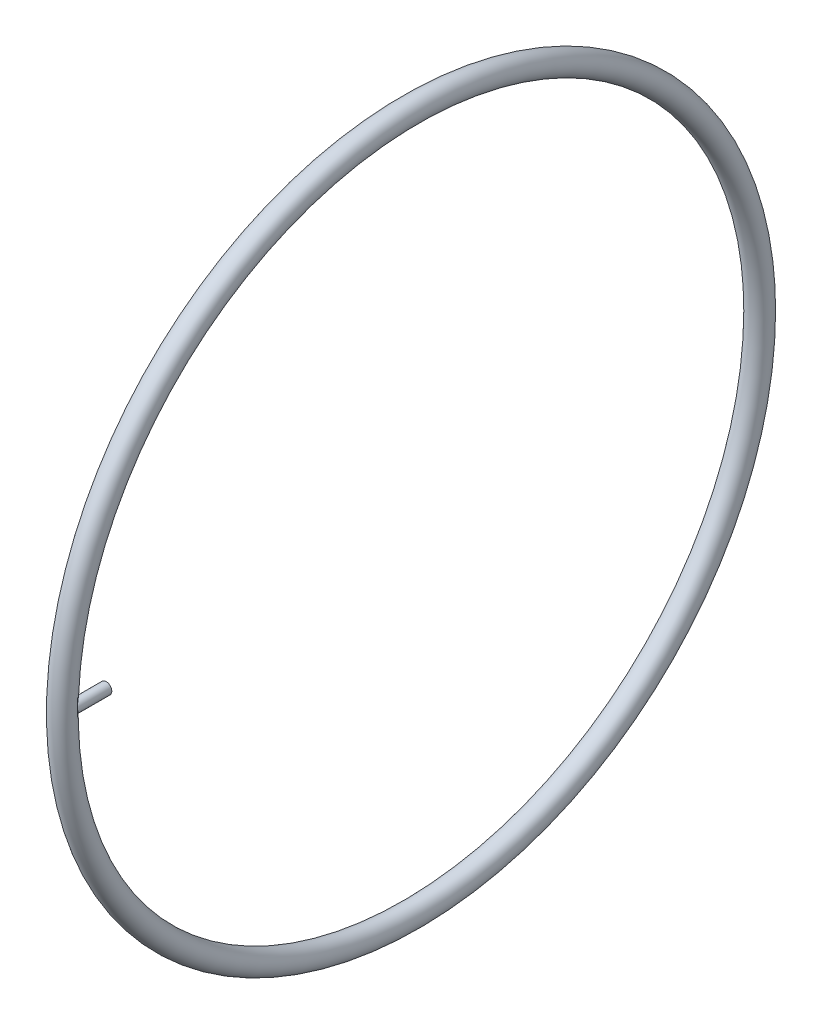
ISO-10303-21;
HEADER;
FILE_DESCRIPTION(('STEP AP214'),'2;1');
FILE_NAME('part.step','',(''),(''),'','','');
FILE_SCHEMA(('AUTOMOTIVE_DESIGN { 1 0 10303 214 1 1 1 1 }'));
ENDSEC;
DATA;
#1=APPLICATION_CONTEXT('core data for automotive mechanical design processes');
#2=APPLICATION_PROTOCOL_DEFINITION('international standard','automotive_design',2000,#1);
#3=PRODUCT_CONTEXT('',#1,'mechanical');
#4=PRODUCT('Part','Part','',(#3));
#5=PRODUCT_RELATED_PRODUCT_CATEGORY('part','',(#4));
#6=PRODUCT_DEFINITION_FORMATION('','',#4);
#7=PRODUCT_DEFINITION_CONTEXT('part definition',#1,'design');
#8=PRODUCT_DEFINITION('design','',#6,#7);
#9=PRODUCT_DEFINITION_SHAPE('','',#8);
#10=(LENGTH_UNIT() NAMED_UNIT(*) SI_UNIT(.MILLI.,.METRE.));
#11=(NAMED_UNIT(*) PLANE_ANGLE_UNIT() SI_UNIT($,.RADIAN.));
#12=(NAMED_UNIT(*) SI_UNIT($,.STERADIAN.) SOLID_ANGLE_UNIT());
#13=UNCERTAINTY_MEASURE_WITH_UNIT(LENGTH_MEASURE(1.E-05),#10,'distance_accuracy_value','');
#14=(GEOMETRIC_REPRESENTATION_CONTEXT(3) GLOBAL_UNCERTAINTY_ASSIGNED_CONTEXT((#13)) GLOBAL_UNIT_ASSIGNED_CONTEXT((#10,
#11,#12)) REPRESENTATION_CONTEXT('',''));
#15=CARTESIAN_POINT('',(0.,0.,0.));
#16=DIRECTION('',(0.,0.,1.));
#17=DIRECTION('',(1.,0.,0.));
#18=AXIS2_PLACEMENT_3D('',#15,#16,#17);
#19=CARTESIAN_POINT('',(0.,0.,0.));
#20=DIRECTION('',(-1.,0.,0.));
#21=DIRECTION('',(0.,0.,1.));
#22=AXIS2_PLACEMENT_3D('',#19,#20,#21);
#23=TOROIDAL_SURFACE('',#22,310.,10.);
#24=CARTESIAN_POINT('',(-3.43548307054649,-3.63283031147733,300.586697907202));
#25=CARTESIAN_POINT('',(-3.63863055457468,-3.44071791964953,300.663343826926));
#26=CARTESIAN_POINT('',(-3.8255240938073,-3.23170310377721,300.741560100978));
#27=CARTESIAN_POINT('',(-4.16289787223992,-2.78370333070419,300.893016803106));
#28=CARTESIAN_POINT('',(-4.31330807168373,-2.54466204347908,300.966247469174));
#29=CARTESIAN_POINT('',(-4.5082572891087,-2.16699418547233,301.065811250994));
#30=CARTESIAN_POINT('',(-4.56825254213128,-2.03753535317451,301.097358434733));
#31=CARTESIAN_POINT('',(-4.67724138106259,-1.77308692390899,301.155850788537));
#32=CARTESIAN_POINT('',(-4.72624008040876,-1.63809993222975,301.182798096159));
#33=CARTESIAN_POINT('',(-4.81259908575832,-1.36365745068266,301.231027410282));
#34=CARTESIAN_POINT('',(-4.84997409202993,-1.22420785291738,301.25231656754));
#35=CARTESIAN_POINT('',(-4.91263070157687,-0.941790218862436,301.288374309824));
#36=CARTESIAN_POINT('',(-4.93791400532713,-0.798822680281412,301.303143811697));
#37=CARTESIAN_POINT('',(-4.97421133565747,-0.524034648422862,301.324458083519));
#38=CARTESIAN_POINT('',(-4.98633031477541,-0.392408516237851,301.331638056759));
#39=CARTESIAN_POINT('',(-5.00009728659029,-0.128421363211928,301.339799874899));
#40=CARTESIAN_POINT('',(-5.00174608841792,0.00393960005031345,301.340782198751));
#41=CARTESIAN_POINT('',(-4.99454848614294,0.268263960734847,301.33650945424));
#42=CARTESIAN_POINT('',(-4.98570270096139,0.400227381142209,301.331254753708));
#43=CARTESIAN_POINT('',(-4.95765043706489,0.662659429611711,301.314718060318));
#44=CARTESIAN_POINT('',(-4.93844417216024,0.793128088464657,301.303436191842));
#45=CARTESIAN_POINT('',(-4.89188447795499,1.04119726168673,301.276405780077));
#46=CARTESIAN_POINT('',(-4.86530686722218,1.1589914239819,301.261087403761));
#47=CARTESIAN_POINT('',(-4.80390050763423,1.39177880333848,301.226187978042));
#48=CARTESIAN_POINT('',(-4.76906900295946,1.50677107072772,301.206605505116));
#49=CARTESIAN_POINT('',(-4.6526817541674,1.84656430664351,301.142285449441));
#50=CARTESIAN_POINT('',(-4.55920311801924,2.06633981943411,301.091956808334));
#51=CARTESIAN_POINT('',(-4.33377226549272,2.50700055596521,300.97657104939));
#52=CARTESIAN_POINT('',(-4.19914933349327,2.72626617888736,300.910605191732));
#53=CARTESIAN_POINT('',(-3.89890155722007,3.14072383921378,300.773594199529));
#54=CARTESIAN_POINT('',(-3.73325656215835,3.33590009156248,300.702545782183));
#55=CARTESIAN_POINT('',(-3.35195012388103,3.72106590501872,300.553091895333));
#56=CARTESIAN_POINT('',(-3.1326627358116,3.90757471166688,300.474835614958));
#57=CARTESIAN_POINT('',(-2.78078479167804,4.15788845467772,300.364863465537));
#58=CARTESIAN_POINT('',(-2.65958685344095,4.23645698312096,300.329422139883));
#59=CARTESIAN_POINT('',(-2.41015380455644,4.38315609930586,300.261951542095));
#60=CARTESIAN_POINT('',(-2.28192218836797,4.45129180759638,300.229920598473));
#61=CARTESIAN_POINT('',(-2.02057923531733,4.57580538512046,300.170491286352));
#62=CARTESIAN_POINT('',(-1.8875338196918,4.63229994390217,300.143047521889));
#63=CARTESIAN_POINT('',(-1.61627023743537,4.73377485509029,300.093190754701));
#64=CARTESIAN_POINT('',(-1.47805459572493,4.77876074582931,300.070775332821));
#65=CARTESIAN_POINT('',(-1.19754984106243,4.85665003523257,300.031654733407));
#66=CARTESIAN_POINT('',(-1.0552630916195,4.88956029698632,300.014946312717));
#67=CARTESIAN_POINT('',(-0.767782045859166,4.94286089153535,299.987756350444));
#68=CARTESIAN_POINT('',(-0.622588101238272,4.9632527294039,299.977274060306));
#69=CARTESIAN_POINT('',(-0.346139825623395,4.98972704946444,299.963640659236));
#70=CARTESIAN_POINT('',(-0.215039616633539,4.997097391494,299.959830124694));
#71=CARTESIAN_POINT('',(0.0473780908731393,5.00149699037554,299.957557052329));
#72=CARTESIAN_POINT('',(0.178695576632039,4.99852683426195,299.959094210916));
#73=CARTESIAN_POINT('',(0.440498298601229,4.98228470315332,299.967474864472));
#74=CARTESIAN_POINT('',(0.570983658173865,4.96901429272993,299.974317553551));
#75=CARTESIAN_POINT('',(0.830144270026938,4.93234119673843,299.993125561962));
#76=CARTESIAN_POINT('',(0.958819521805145,4.90893850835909,300.005090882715));
#77=CARTESIAN_POINT('',(1.20790812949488,4.85350603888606,300.033211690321));
#78=CARTESIAN_POINT('',(1.32843780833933,4.82189429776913,300.049163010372));
#79=CARTESIAN_POINT('',(1.56626943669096,4.74997437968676,300.085100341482));
#80=CARTESIAN_POINT('',(1.68357033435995,4.70966340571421,300.105087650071));
#81=CARTESIAN_POINT('',(2.02956060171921,4.57623018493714,300.170455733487));
#82=CARTESIAN_POINT('',(2.25252714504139,4.4705648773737,300.221265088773));
#83=CARTESIAN_POINT('',(2.69335050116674,4.22072963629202,300.337031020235));
#84=CARTESIAN_POINT('',(2.90977004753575,4.07439062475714,300.402726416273));
#85=CARTESIAN_POINT('',(3.31627797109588,3.75097365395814,300.540107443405));
#86=CARTESIAN_POINT('',(3.50634823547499,3.57387473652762,300.611797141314));
#87=CARTESIAN_POINT('',(3.87478578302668,3.17294436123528,300.7622105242));
#88=CARTESIAN_POINT('',(4.04999203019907,2.9461908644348,300.840907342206));
#89=CARTESIAN_POINT('',(4.36034379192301,2.46363827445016,300.98908364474));
#90=CARTESIAN_POINT('',(4.49548425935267,2.20783552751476,301.058561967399));
#91=CARTESIAN_POINT('',(4.66404864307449,1.80763651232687,301.148666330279));
#92=CARTESIAN_POINT('',(4.71447953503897,1.67177234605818,301.176308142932));
#93=CARTESIAN_POINT('',(4.80357242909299,1.39525990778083,301.225924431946));
#94=CARTESIAN_POINT('',(4.84224073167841,1.2546142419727,301.24790194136));
#95=CARTESIAN_POINT('',(4.90722136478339,0.969793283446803,301.285232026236));
#96=CARTESIAN_POINT('',(4.93354683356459,0.825621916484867,301.300591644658));
#97=CARTESIAN_POINT('',(4.97346377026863,0.534944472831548,301.324008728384));
#98=CARTESIAN_POINT('',(4.98705734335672,0.388438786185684,301.332067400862));
#99=CARTESIAN_POINT('',(5.00033854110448,0.113848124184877,301.33994453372));
#100=CARTESIAN_POINT('',(5.00161440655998,-0.0141360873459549,301.34070407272));
#101=CARTESIAN_POINT('',(4.9943546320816,-0.269770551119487,301.336394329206));
#102=CARTESIAN_POINT('',(4.98581588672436,-0.397420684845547,301.331323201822));
#103=CARTESIAN_POINT('',(4.95903997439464,-0.651312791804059,301.315535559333));
#104=CARTESIAN_POINT('',(4.94080537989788,-0.777555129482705,301.304820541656));
#105=CARTESIAN_POINT('',(4.89488630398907,-1.02776177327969,301.278137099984));
#106=CARTESIAN_POINT('',(4.8671980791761,-1.15172515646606,301.262166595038));
#107=CARTESIAN_POINT('',(4.7730885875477,-1.50876861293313,301.208668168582));
#108=CARTESIAN_POINT('',(4.69441883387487,-1.73779711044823,301.164793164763));
#109=CARTESIAN_POINT('',(4.50630307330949,-2.17969143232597,301.064461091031));
#110=CARTESIAN_POINT('',(4.39684710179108,-2.39255199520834,301.007999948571));
#111=CARTESIAN_POINT('',(4.13561220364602,-2.82260803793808,300.880808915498));
#112=CARTESIAN_POINT('',(3.98040094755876,-3.03745350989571,300.809183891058));
#113=CARTESIAN_POINT('',(3.63831602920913,-3.43982613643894,300.663910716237));
#114=CARTESIAN_POINT('',(3.45142037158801,-3.62733414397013,300.590261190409));
#115=CARTESIAN_POINT('',(3.14011617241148,-3.89368865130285,300.47987625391));
#116=CARTESIAN_POINT('',(3.02546429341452,-3.98344568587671,300.441451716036));
#117=CARTESIAN_POINT('',(2.78824516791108,-4.15294063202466,300.367084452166));
#118=CARTESIAN_POINT('',(2.66568096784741,-4.2326823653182,300.331140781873));
#119=CARTESIAN_POINT('',(2.41328331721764,-4.38149906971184,300.262730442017));
#120=CARTESIAN_POINT('',(2.28344849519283,-4.45057201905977,300.230264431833));
#121=CARTESIAN_POINT('',(2.01740652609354,-4.57730957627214,300.169773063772));
#122=CARTESIAN_POINT('',(1.88120289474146,-4.63498038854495,300.141745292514));
#123=CARTESIAN_POINT('',(1.60984968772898,-4.73585734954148,300.092152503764));
#124=CARTESIAN_POINT('',(1.47494902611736,-4.77961407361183,300.070346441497));
#125=CARTESIAN_POINT('',(1.20125798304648,-4.85562936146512,300.032167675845));
#126=CARTESIAN_POINT('',(1.0624695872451,-4.88789368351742,300.015792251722));
#127=CARTESIAN_POINT('',(0.782158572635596,-4.94050124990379,299.988964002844));
#128=CARTESIAN_POINT('',(0.64063741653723,-4.96085069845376,299.978508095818));
#129=CARTESIAN_POINT('',(0.356055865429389,-4.98935545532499,299.963834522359));
#130=CARTESIAN_POINT('',(0.212995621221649,-4.99751194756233,299.959616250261));
#131=CARTESIAN_POINT('',(-0.0584365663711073,-5.00130457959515,299.9576561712));
#132=CARTESIAN_POINT('',(-0.186788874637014,-4.99815452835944,299.959286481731));
#133=CARTESIAN_POINT('',(-0.442749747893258,-4.98200985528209,299.967616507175));
#134=CARTESIAN_POINT('',(-0.570358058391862,-4.96901204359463,299.974317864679));
#135=CARTESIAN_POINT('',(-0.823840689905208,-4.93332151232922,299.992623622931));
#136=CARTESIAN_POINT('',(-0.949715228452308,-4.91063002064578,300.004227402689));
#137=CARTESIAN_POINT('',(-1.19889099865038,-4.85581719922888,300.032044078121));
#138=CARTESIAN_POINT('',(-1.3221912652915,-4.82369239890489,300.04825867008));
#139=CARTESIAN_POINT('',(-1.68375032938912,-4.71462351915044,300.102776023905));
#140=CARTESIAN_POINT('',(-1.91724035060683,-4.62446840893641,300.147227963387));
#141=CARTESIAN_POINT('',(-2.36566266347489,-4.41194358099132,300.248736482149));
#142=CARTESIAN_POINT('',(-2.58061106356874,-4.28960220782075,300.305781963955));
#143=CARTESIAN_POINT('',(-2.90044732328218,-4.07515682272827,300.40147604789));
#144=CARTESIAN_POINT('',(-3.01280623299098,-3.99278275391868,300.437442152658));
#145=CARTESIAN_POINT('',(-3.22993755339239,-3.81926883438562,300.511042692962));
#146=CARTESIAN_POINT('',(-3.33471014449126,-3.72812919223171,300.548677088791));
#147=CARTESIAN_POINT('',(-3.43548307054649,-3.63283031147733,300.586697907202));
#148=B_SPLINE_CURVE_WITH_KNOTS('',3,(#24,#25,#26,#27,#28,#29,#30,#31,#32,#33,#34,#35,#36,#37,
#38,#39,#40,#41,#42,#43,#44,#45,#46,#47,#48,#49,#50,#51,#52,#53,#54,#55,#56,#57,#58,#59,#60,#61,
#62,#63,#64,#65,#66,#67,#68,#69,#70,#71,#72,#73,#74,#75,#76,#77,#78,#79,#80,#81,#82,#83,#84,#85,
#86,#87,#88,#89,#90,#91,#92,#93,#94,#95,#96,#97,#98,#99,#100,#101,#102,#103,#104,#105,#106,#107,
#108,#109,#110,#111,#112,#113,#114,#115,#116,#117,#118,#119,#120,#121,#122,#123,#124,#125,#126,
#127,#128,#129,#130,#131,#132,#133,#134,#135,#136,#137,#138,#139,#140,#141,#142,#143,#144,#145,
#146,#147),.UNSPECIFIED.,.T.,.F.,(4,2,2,2,2,2,2,2,2,2,2,2,2,2,2,2,2,2,2,2,2,2,2,2,2,2,2,2,2,2,2,
2,2,2,2,2,2,2,2,2,2,2,2,2,2,2,2,2,2,2,2,2,2,2,2,2,2,2,2,2,2,4),(0.,0.869283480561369,
1.74022280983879,2.17812441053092,2.61582196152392,3.05296369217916,3.4900439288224,
3.88663157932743,4.28318858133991,4.67972219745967,5.07624763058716,5.44101126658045,
5.8058968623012,6.53518738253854,7.32895202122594,8.1232340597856,9.01355737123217,
9.45926222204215,9.90474760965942,10.345523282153,10.7860864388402,11.2263988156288,
11.6666582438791,12.0602417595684,12.4538029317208,12.8473043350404,13.2408058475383,
13.6172462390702,13.9938078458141,14.7463507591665,15.5513027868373,16.3568054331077,
17.2443071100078,18.1319205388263,18.5739835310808,19.0158093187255,19.4571637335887,
19.898445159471,20.2819255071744,20.6655272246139,21.049027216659,21.4326792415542,
22.1677247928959,22.9030085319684,23.7233989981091,24.5443613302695,24.9956616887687,
25.4467893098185,25.8980023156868,26.3489691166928,26.7788335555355,27.2084823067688,
27.6379071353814,28.0672902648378,28.4520210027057,28.8368764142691,29.2216830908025,
29.606631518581,30.3658002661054,31.1243026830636,31.5555279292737,31.9867429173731),.UNSPECIFIED.);
#149=CARTESIAN_POINT('',(-3.43548307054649,-3.63283031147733,300.586697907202));
#150=VERTEX_POINT('',#149);
#151=EDGE_CURVE('E10',#150,#150,#148,.T.);
#152=ORIENTED_EDGE('',*,*,#151,.F.);
#153=EDGE_LOOP('',(#152));
#154=FACE_BOUND('',#153,.T.);
#155=ADVANCED_FACE('F30',(#154),#23,.T.);
#156=CARTESIAN_POINT('',(0.,0.,271.));
#157=DIRECTION('',(0.,0.,1.));
#158=DIRECTION('',(1.,0.,0.));
#159=AXIS2_PLACEMENT_3D('',#156,#157,#158);
#160=PLANE('',#159);
#161=CARTESIAN_POINT('',(0.,0.,271.));
#162=DIRECTION('',(0.,0.,-1.));
#163=DIRECTION('',(-1.,0.,0.));
#164=AXIS2_PLACEMENT_3D('',#161,#162,#163);
#165=CIRCLE('',#164,4.);
#166=CARTESIAN_POINT('',(-4.,0.,271.));
#167=VERTEX_POINT('',#166);
#168=EDGE_CURVE('E45',#167,#167,#165,.T.);
#169=ORIENTED_EDGE('',*,*,#168,.F.);
#170=EDGE_LOOP('',(#169));
#171=FACE_BOUND('',#170,.T.);
#172=CARTESIAN_POINT('',(0.,0.,271.));
#173=DIRECTION('',(0.,0.,1.));
#174=DIRECTION('',(1.,0.,0.));
#175=AXIS2_PLACEMENT_3D('',#172,#173,#174);
#176=CIRCLE('',#175,5.);
#177=CARTESIAN_POINT('',(5.,0.,271.));
#178=VERTEX_POINT('',#177);
#179=EDGE_CURVE('E41',#178,#178,#176,.T.);
#180=ORIENTED_EDGE('',*,*,#179,.F.);
#181=EDGE_LOOP('',(#180));
#182=FACE_BOUND('',#181,.T.);
#183=ADVANCED_FACE('F62',(#171,#182),#160,.F.);
#184=CARTESIAN_POINT('',(0.,0.,500000.));
#185=DIRECTION('',(0.,0.,-1.));
#186=DIRECTION('',(-1.,0.,0.));
#187=AXIS2_PLACEMENT_3D('',#184,#185,#186);
#188=CYLINDRICAL_SURFACE('',#187,5.);
#189=ORIENTED_EDGE('',*,*,#179,.T.);
#190=EDGE_LOOP('',(#189));
#191=FACE_BOUND('',#190,.T.);
#192=ORIENTED_EDGE('',*,*,#151,.T.);
#193=EDGE_LOOP('',(#192));
#194=FACE_BOUND('',#193,.T.);
#195=ADVANCED_FACE('F64',(#191,#194),#188,.T.);
#196=CARTESIAN_POINT('',(0.,0.,320.001));
#197=DIRECTION('',(0.,0.,-1.));
#198=DIRECTION('',(-1.,0.,0.));
#199=AXIS2_PLACEMENT_3D('',#196,#197,#198);
#200=CYLINDRICAL_SURFACE('',#199,4.);
#201=CARTESIAN_POINT('',(-2.6291224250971,-3.01458378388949,301.377501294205));
#202=CARTESIAN_POINT('',(-2.79893950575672,-2.86647423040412,301.430858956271));
#203=CARTESIAN_POINT('',(-2.95614985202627,-2.70406136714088,301.48591609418));
#204=CARTESIAN_POINT('',(-3.24166905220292,-2.35430215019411,301.59354988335));
#205=CARTESIAN_POINT('',(-3.36990662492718,-2.16689606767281,301.646120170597));
#206=CARTESIAN_POINT('',(-3.59391081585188,-1.7707741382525,301.742680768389));
#207=CARTESIAN_POINT('',(-3.68959682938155,-1.56200703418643,301.786649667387));
#208=CARTESIAN_POINT('',(-3.84421856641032,-1.12901988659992,301.859825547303));
#209=CARTESIAN_POINT('',(-3.90320620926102,-0.904822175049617,301.889053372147));
#210=CARTESIAN_POINT('',(-3.97898280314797,-0.463145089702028,301.926965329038));
#211=CARTESIAN_POINT('',(-3.99831841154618,-0.246211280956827,301.936886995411));
#212=CARTESIAN_POINT('',(-4.00146959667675,0.187971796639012,301.93848952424));
#213=CARTESIAN_POINT('',(-3.98529249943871,0.405220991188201,301.930174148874));
#214=CARTESIAN_POINT('',(-3.9207423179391,0.81741808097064,301.89779253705));
#215=CARTESIAN_POINT('',(-3.87477107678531,1.01284548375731,301.874903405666));
#216=CARTESIAN_POINT('',(-3.7548827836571,1.39306016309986,301.817284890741));
#217=CARTESIAN_POINT('',(-3.68095858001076,1.57784470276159,301.78255247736));
#218=CARTESIAN_POINT('',(-3.50258463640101,1.94306896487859,301.702730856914));
#219=CARTESIAN_POINT('',(-3.39664882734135,2.12267632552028,301.657168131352));
#220=CARTESIAN_POINT('',(-3.15890479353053,2.46259539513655,301.561613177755));
#221=CARTESIAN_POINT('',(-3.02708339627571,2.62289721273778,301.511618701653));
#222=CARTESIAN_POINT('',(-2.72630295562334,2.93578526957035,301.407003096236));
#223=CARTESIAN_POINT('',(-2.5549817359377,3.08611437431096,301.352403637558));
#224=CARTESIAN_POINT('',(-2.18792995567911,3.35630665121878,301.2492661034));
#225=CARTESIAN_POINT('',(-1.99219753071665,3.47616749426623,301.200728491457));
#226=CARTESIAN_POINT('',(-1.684057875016,3.63004073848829,301.136461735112));
#227=CARTESIAN_POINT('',(-1.5788446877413,3.67703525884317,301.116452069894));
#228=CARTESIAN_POINT('',(-1.3642542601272,3.76192761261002,301.079839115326));
#229=CARTESIAN_POINT('',(-1.25487892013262,3.79982954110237,301.06323429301));
#230=CARTESIAN_POINT('',(-1.03281535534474,3.86609864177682,301.033934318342));
#231=CARTESIAN_POINT('',(-0.920128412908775,3.89446945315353,301.021237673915));
#232=CARTESIAN_POINT('',(-0.692326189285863,3.94134512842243,301.000137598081));
#233=CARTESIAN_POINT('',(-0.577211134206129,3.95985090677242,300.991733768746));
#234=CARTESIAN_POINT('',(-0.355299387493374,3.98562072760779,300.980000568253));
#235=CARTESIAN_POINT('',(-0.248615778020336,3.99369818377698,300.976304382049));
#236=CARTESIAN_POINT('',(-0.0348432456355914,4.00127842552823,300.972836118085));
#237=CARTESIAN_POINT('',(0.0722457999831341,4.00077836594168,300.973065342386));
#238=CARTESIAN_POINT('',(0.285904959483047,3.9912006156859,300.977446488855));
#239=CARTESIAN_POINT('',(0.39247532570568,3.9821276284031,300.981596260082));
#240=CARTESIAN_POINT('',(0.604349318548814,3.95552571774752,300.993695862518));
#241=CARTESIAN_POINT('',(0.709652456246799,3.9379936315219,301.001647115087));
#242=CARTESIAN_POINT('',(1.0139713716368,3.8747257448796,301.030122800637));
#243=CARTESIAN_POINT('',(1.21035093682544,3.81787056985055,301.055490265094));
#244=CARTESIAN_POINT('',(1.59057160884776,3.67578227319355,301.117141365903));
#245=CARTESIAN_POINT('',(1.77441032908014,3.59054376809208,301.153427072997));
#246=CARTESIAN_POINT('',(2.13539455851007,3.38896494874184,301.235895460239));
#247=CARTESIAN_POINT('',(2.31164265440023,3.27119376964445,301.282506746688));
#248=CARTESIAN_POINT('',(2.64274364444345,3.01005263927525,301.380020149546));
#249=CARTESIAN_POINT('',(2.7975846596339,2.86666857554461,301.430924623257));
#250=CARTESIAN_POINT('',(3.09458423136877,2.54467536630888,301.536487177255));
#251=CARTESIAN_POINT('',(3.23467845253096,2.36414707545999,301.59111278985));
#252=CARTESIAN_POINT('',(3.48287324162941,1.98033209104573,301.69370840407));
#253=CARTESIAN_POINT('',(3.5909722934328,1.77704431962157,301.741678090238));
#254=CARTESIAN_POINT('',(3.72597953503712,1.45954442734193,301.80384161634));
#255=CARTESIAN_POINT('',(3.76640177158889,1.35185564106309,301.822901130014));
#256=CARTESIAN_POINT('',(3.83795343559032,1.13285398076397,301.857152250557));
#257=CARTESIAN_POINT('',(3.86908734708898,1.02154288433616,301.872345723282));
#258=CARTESIAN_POINT('',(3.92165871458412,0.796223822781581,301.898264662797));
#259=CARTESIAN_POINT('',(3.94310257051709,0.682217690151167,301.908993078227));
#260=CARTESIAN_POINT('',(3.97602523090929,0.452425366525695,301.92555364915));
#261=CARTESIAN_POINT('',(3.98750517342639,0.336639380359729,301.931386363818));
#262=CARTESIAN_POINT('',(3.99968417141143,0.116066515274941,301.937578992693));
#263=CARTESIAN_POINT('',(4.00135209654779,0.0113456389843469,301.938430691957));
#264=CARTESIAN_POINT('',(3.99647268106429,-0.197890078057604,301.935945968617));
#265=CARTESIAN_POINT('',(3.98992266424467,-0.30240484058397,301.932608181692));
#266=CARTESIAN_POINT('',(3.96868400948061,-0.510355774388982,301.921858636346));
#267=CARTESIAN_POINT('',(3.95399835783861,-0.613792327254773,301.914448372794));
#268=CARTESIAN_POINT('',(3.91667122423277,-0.818883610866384,301.895814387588));
#269=CARTESIAN_POINT('',(3.89402666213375,-0.920537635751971,301.884589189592));
#270=CARTESIAN_POINT('',(3.81622973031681,-1.21517584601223,301.846562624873));
#271=CARTESIAN_POINT('',(3.7504615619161,-1.40486073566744,301.815001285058));
#272=CARTESIAN_POINT('',(3.59228748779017,-1.7706764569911,301.742411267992));
#273=CARTESIAN_POINT('',(3.49987310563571,-1.94680295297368,301.701379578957));
#274=CARTESIAN_POINT('',(3.2815731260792,-2.29728487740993,301.609998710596));
#275=CARTESIAN_POINT('',(3.15346052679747,-2.47012586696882,301.55914768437));
#276=CARTESIAN_POINT('',(2.87149281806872,-2.7929471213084,301.456165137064));
#277=CARTESIAN_POINT('',(2.71762407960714,-2.94291520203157,301.404032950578));
#278=CARTESIAN_POINT('',(2.37455947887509,-3.22716635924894,301.299686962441));
#279=CARTESIAN_POINT('',(2.18358122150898,-3.35943455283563,301.247759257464));
#280=CARTESIAN_POINT('',(1.88094645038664,-3.53208034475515,301.177430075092));
#281=CARTESIAN_POINT('',(1.77732014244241,-3.58535551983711,301.155238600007));
#282=CARTESIAN_POINT('',(1.56531148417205,-3.682850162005,301.113995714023));
#283=CARTESIAN_POINT('',(1.45693157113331,-3.72707420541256,301.094942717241));
#284=CARTESIAN_POINT('',(1.24049923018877,-3.80445203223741,301.061220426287));
#285=CARTESIAN_POINT('',(1.1325990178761,-3.83797042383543,301.046409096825));
#286=CARTESIAN_POINT('',(0.913959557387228,-3.89582541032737,301.020644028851));
#287=CARTESIAN_POINT('',(0.803221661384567,-3.92016629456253,301.009688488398));
#288=CARTESIAN_POINT('',(0.579795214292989,-3.95938092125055,300.991956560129));
#289=CARTESIAN_POINT('',(0.467107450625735,-3.97425839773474,300.985178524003));
#290=CARTESIAN_POINT('',(0.24070008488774,-3.99436811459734,300.976002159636));
#291=CARTESIAN_POINT('',(0.126980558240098,-3.99960105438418,300.973603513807));
#292=CARTESIAN_POINT('',(-0.091039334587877,-4.0003237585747,300.973272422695));
#293=CARTESIAN_POINT('',(-0.195337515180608,-3.99658668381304,300.974985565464));
#294=CARTESIAN_POINT('',(-0.403232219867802,-3.98098903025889,300.982109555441));
#295=CARTESIAN_POINT('',(-0.506828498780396,-3.96912574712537,300.987521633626));
#296=CARTESIAN_POINT('',(-0.712543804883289,-3.93739884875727,301.001907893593));
#297=CARTESIAN_POINT('',(-0.814662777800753,-3.91753494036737,301.010882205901));
#298=CARTESIAN_POINT('',(-1.01673098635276,-3.87001903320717,301.032162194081));
#299=CARTESIAN_POINT('',(-1.1166794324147,-3.84236424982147,301.044469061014));
#300=CARTESIAN_POINT('',(-1.41093024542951,-3.74851953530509,301.085770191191));
#301=CARTESIAN_POINT('',(-1.60117366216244,-3.67120774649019,301.11925926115));
#302=CARTESIAN_POINT('',(-1.96588452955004,-3.48952516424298,301.195158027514));
#303=CARTESIAN_POINT('',(-2.1403751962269,-3.38519509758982,301.237554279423));
#304=CARTESIAN_POINT('',(-2.36159114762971,-3.22918319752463,301.297867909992));
#305=CARTESIAN_POINT('',(-2.41669157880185,-3.18815148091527,301.313491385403));
#306=CARTESIAN_POINT('',(-2.52462433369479,-3.1033822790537,301.345191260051));
#307=CARTESIAN_POINT('',(-2.57745684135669,-3.05964501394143,301.361267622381));
#308=CARTESIAN_POINT('',(-2.6291224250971,-3.01458378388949,301.377501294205));
#309=B_SPLINE_CURVE_WITH_KNOTS('',3,(#201,#202,#203,#204,#205,#206,#207,#208,#209,#210,#211,
#212,#213,#214,#215,#216,#217,#218,#219,#220,#221,#222,#223,#224,#225,#226,#227,#228,#229,#230,
#231,#232,#233,#234,#235,#236,#237,#238,#239,#240,#241,#242,#243,#244,#245,#246,#247,#248,#249,
#250,#251,#252,#253,#254,#255,#256,#257,#258,#259,#260,#261,#262,#263,#264,#265,#266,#267,#268,
#269,#270,#271,#272,#273,#274,#275,#276,#277,#278,#279,#280,#281,#282,#283,#284,#285,#286,#287,
#288,#289,#290,#291,#292,#293,#294,#295,#296,#297,#298,#299,#300,#301,#302,#303,#304,#305,#306,
#307,#308),.UNSPECIFIED.,.T.,.F.,(4,2,2,2,2,2,2,2,2,2,2,2,2,2,2,2,2,2,2,2,2,2,2,2,2,2,2,2,2,2,2,
2,2,2,2,2,2,2,2,2,2,2,2,2,2,2,2,2,2,2,2,2,2,4),(0.,0.694437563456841,1.39056547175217,
2.08840480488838,2.78525460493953,3.43573747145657,4.08608616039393,4.68961219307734,
5.29329274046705,5.93100941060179,6.5690514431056,7.2689908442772,7.96898373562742,
8.31945692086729,8.66977196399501,9.01995309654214,9.37010176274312,9.69085151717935,
10.0117076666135,10.3323878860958,10.6531881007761,11.2682345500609,11.8833977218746,
12.5317775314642,13.1805157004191,13.882164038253,14.5838456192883,14.9332221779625,
15.2824297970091,15.6314064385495,15.9803432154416,16.2941566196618,16.6080722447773,
16.9218727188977,17.2357947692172,17.8426750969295,18.4497486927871,19.110145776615,
19.7708934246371,20.4811094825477,20.8365580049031,21.1918263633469,21.5332330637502,
21.8744800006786,22.215592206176,22.5566796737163,22.8694366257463,23.1822977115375,
23.4951702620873,23.8081547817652,24.4295055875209,25.0499251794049,25.2612198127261,
25.4724972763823),.UNSPECIFIED.);
#310=CARTESIAN_POINT('',(-2.6291224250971,-3.01458378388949,301.377501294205));
#311=VERTEX_POINT('',#310);
#312=EDGE_CURVE('E49',#311,#311,#309,.T.);
#313=ORIENTED_EDGE('',*,*,#312,.F.);
#314=EDGE_LOOP('',(#313));
#315=FACE_BOUND('',#314,.T.);
#316=ORIENTED_EDGE('',*,*,#168,.T.);
#317=EDGE_LOOP('',(#316));
#318=FACE_BOUND('',#317,.T.);
#319=ADVANCED_FACE('F58',(#315,#318),#200,.F.);
#320=CARTESIAN_POINT('',(0.,0.,0.));
#321=DIRECTION('',(-1.,0.,0.));
#322=DIRECTION('',(0.,0.,1.));
#323=AXIS2_PLACEMENT_3D('',#320,#321,#322);
#324=TOROIDAL_SURFACE('',#323,310.,9.);
#325=ORIENTED_EDGE('',*,*,#312,.T.);
#326=EDGE_LOOP('',(#325));
#327=FACE_BOUND('',#326,.T.);
#328=ADVANCED_FACE('F68',(#327),#324,.F.);
#329=CLOSED_SHELL('',(#155,#183,#195,#319,#328));
#330=MANIFOLD_SOLID_BREP('B2',#329);
#331=ADVANCED_BREP_SHAPE_REPRESENTATION('',(#18,#330),#14);
#332=SHAPE_DEFINITION_REPRESENTATION(#9,#331);
ENDSEC;
END-ISO-10303-21;
